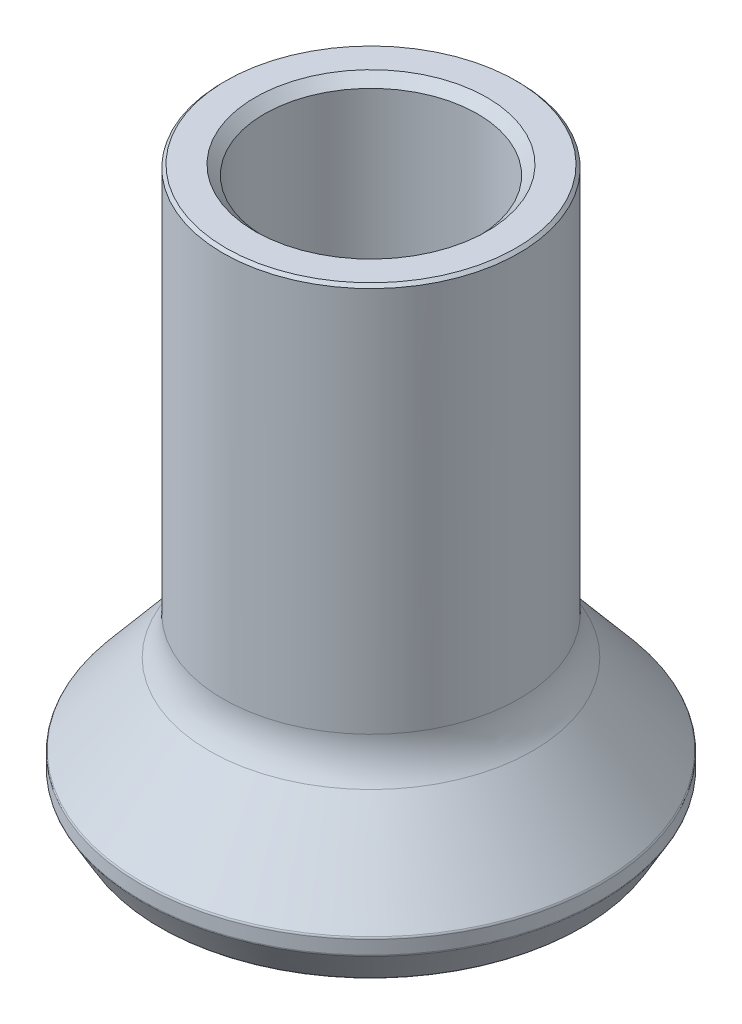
ISO-10303-21;
HEADER;
FILE_DESCRIPTION(('STEP AP214'),'2;1');
FILE_NAME('part.step','',(''),(''),'','','');
FILE_SCHEMA(('AUTOMOTIVE_DESIGN { 1 0 10303 214 1 1 1 1 }'));
ENDSEC;
DATA;
#1=APPLICATION_CONTEXT('core data for automotive mechanical design processes');
#2=APPLICATION_PROTOCOL_DEFINITION('international standard','automotive_design',2000,#1);
#3=PRODUCT_CONTEXT('',#1,'mechanical');
#4=PRODUCT('Part','Part','',(#3));
#5=PRODUCT_RELATED_PRODUCT_CATEGORY('part','',(#4));
#6=PRODUCT_DEFINITION_FORMATION('','',#4);
#7=PRODUCT_DEFINITION_CONTEXT('part definition',#1,'design');
#8=PRODUCT_DEFINITION('design','',#6,#7);
#9=PRODUCT_DEFINITION_SHAPE('','',#8);
#10=(LENGTH_UNIT() NAMED_UNIT(*) SI_UNIT(.MILLI.,.METRE.));
#11=(NAMED_UNIT(*) PLANE_ANGLE_UNIT() SI_UNIT($,.RADIAN.));
#12=(NAMED_UNIT(*) SI_UNIT($,.STERADIAN.) SOLID_ANGLE_UNIT());
#13=UNCERTAINTY_MEASURE_WITH_UNIT(LENGTH_MEASURE(1.E-05),#10,'distance_accuracy_value','');
#14=(GEOMETRIC_REPRESENTATION_CONTEXT(3) GLOBAL_UNCERTAINTY_ASSIGNED_CONTEXT((#13)) GLOBAL_UNIT_ASSIGNED_CONTEXT((#10,
#11,#12)) REPRESENTATION_CONTEXT('',''));
#15=CARTESIAN_POINT('',(0.,0.,0.));
#16=DIRECTION('',(0.,0.,1.));
#17=DIRECTION('',(1.,0.,0.));
#18=AXIS2_PLACEMENT_3D('',#15,#16,#17);
#19=CARTESIAN_POINT('',(17.205661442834,0.,0.));
#20=DIRECTION('',(0.,-1.,0.));
#21=DIRECTION('',(0.,0.,-1.));
#22=AXIS2_PLACEMENT_3D('',#19,#20,#21);
#23=PLANE('',#22);
#24=CARTESIAN_POINT('',(0.,0.,0.));
#25=DIRECTION('',(0.,-1.,0.));
#26=DIRECTION('',(0.,0.,-1.));
#27=AXIS2_PLACEMENT_3D('',#24,#25,#26);
#28=CIRCLE('',#27,17.3649290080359);
#29=CARTESIAN_POINT('',(0.,0.,-17.3649290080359));
#30=VERTEX_POINT('',#29);
#31=EDGE_CURVE('E54',#30,#30,#28,.F.);
#32=ORIENTED_EDGE('',*,*,#31,.T.);
#33=EDGE_LOOP('',(#32));
#34=FACE_BOUND('',#33,.T.);
#35=CARTESIAN_POINT('',(0.,0.,0.));
#36=DIRECTION('',(0.,-1.,0.));
#37=DIRECTION('',(0.,0.,-1.));
#38=AXIS2_PLACEMENT_3D('',#35,#36,#37);
#39=CIRCLE('',#38,17.6390816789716);
#40=CARTESIAN_POINT('',(0.,0.,-17.6390816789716));
#41=VERTEX_POINT('',#40);
#42=EDGE_CURVE('E59',#41,#41,#39,.T.);
#43=ORIENTED_EDGE('',*,*,#42,.T.);
#44=EDGE_LOOP('',(#43));
#45=FACE_BOUND('',#44,.T.);
#46=ADVANCED_FACE('F38',(#34,#45),#23,.T.);
#47=CARTESIAN_POINT('',(0.,2.8,0.));
#48=DIRECTION('',(0.,-1.,0.));
#49=DIRECTION('',(0.,0.,-1.));
#50=AXIS2_PLACEMENT_3D('',#47,#48,#49);
#51=CONICAL_SURFACE('',#50,15.9,0.43633231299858);
#52=CARTESIAN_POINT('',(0.,0.144345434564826,0.));
#53=DIRECTION('',(0.,1.,0.));
#54=DIRECTION('',(0.,0.,1.));
#55=AXIS2_PLACEMENT_3D('',#52,#53,#54);
#56=CIRCLE('',#55,17.1383520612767);
#57=CARTESIAN_POINT('',(0.,0.144345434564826,17.1383520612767));
#58=VERTEX_POINT('',#57);
#59=EDGE_CURVE('E62',#58,#58,#56,.F.);
#60=ORIENTED_EDGE('',*,*,#59,.T.);
#61=EDGE_LOOP('',(#60));
#62=FACE_BOUND('',#61,.T.);
#63=CARTESIAN_POINT('',(0.,2.65565456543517,0.));
#64=DIRECTION('',(0.,-1.,0.));
#65=DIRECTION('',(0.,0.,-1.));
#66=AXIS2_PLACEMENT_3D('',#63,#64,#65);
#67=CIRCLE('',#66,15.9673093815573);
#68=CARTESIAN_POINT('',(0.,2.65565456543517,-15.9673093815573));
#69=VERTEX_POINT('',#68);
#70=EDGE_CURVE('E65',#69,#69,#67,.F.);
#71=ORIENTED_EDGE('',*,*,#70,.T.);
#72=EDGE_LOOP('',(#71));
#73=FACE_BOUND('',#72,.T.);
#74=ADVANCED_FACE('F134',(#62,#73),#51,.F.);
#75=CARTESIAN_POINT('',(7.05,2.8,0.));
#76=DIRECTION('',(0.,-1.,0.));
#77=DIRECTION('',(0.,0.,-1.));
#78=AXIS2_PLACEMENT_3D('',#75,#76,#77);
#79=PLANE('',#78);
#80=CARTESIAN_POINT('',(0.,2.8,0.));
#81=DIRECTION('',(0.,-1.,0.));
#82=DIRECTION('',(0.,0.,-1.));
#83=AXIS2_PLACEMENT_3D('',#80,#81,#82);
#84=CIRCLE('',#83,15.7407324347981);
#85=CARTESIAN_POINT('',(0.,2.8,-15.7407324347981));
#86=VERTEX_POINT('',#85);
#87=EDGE_CURVE('E50',#86,#86,#84,.T.);
#88=ORIENTED_EDGE('',*,*,#87,.T.);
#89=EDGE_LOOP('',(#88));
#90=FACE_BOUND('',#89,.T.);
#91=CARTESIAN_POINT('',(0.,2.8,0.));
#92=DIRECTION('',(0.,-1.,0.));
#93=DIRECTION('',(0.,0.,-1.));
#94=AXIS2_PLACEMENT_3D('',#91,#92,#93);
#95=CIRCLE('',#94,7.55);
#96=CARTESIAN_POINT('',(0.,2.8,-7.55));
#97=VERTEX_POINT('',#96);
#98=EDGE_CURVE('E89',#97,#97,#95,.F.);
#99=ORIENTED_EDGE('',*,*,#98,.T.);
#100=EDGE_LOOP('',(#99));
#101=FACE_BOUND('',#100,.T.);
#102=ADVANCED_FACE('F140',(#90,#101),#79,.T.);
#103=CARTESIAN_POINT('',(0.,0.,0.));
#104=DIRECTION('',(0.,-1.,0.));
#105=DIRECTION('',(0.,0.,-1.));
#106=AXIS2_PLACEMENT_3D('',#103,#104,#105);
#107=CYLINDRICAL_SURFACE('',#106,7.05);
#108=CARTESIAN_POINT('',(0.,3.3,0.));
#109=DIRECTION('',(0.,-1.,0.));
#110=DIRECTION('',(0.,0.,-1.));
#111=AXIS2_PLACEMENT_3D('',#108,#109,#110);
#112=CIRCLE('',#111,7.05);
#113=CARTESIAN_POINT('',(0.,3.3,-7.05));
#114=VERTEX_POINT('',#113);
#115=EDGE_CURVE('E92',#114,#114,#112,.T.);
#116=ORIENTED_EDGE('',*,*,#115,.T.);
#117=EDGE_LOOP('',(#116));
#118=FACE_BOUND('',#117,.T.);
#119=CARTESIAN_POINT('',(0.,10.8,0.));
#120=DIRECTION('',(0.,-1.,0.));
#121=DIRECTION('',(0.,0.,-1.));
#122=AXIS2_PLACEMENT_3D('',#119,#120,#121);
#123=CIRCLE('',#122,7.05);
#124=CARTESIAN_POINT('',(0.,10.8,-7.05));
#125=VERTEX_POINT('',#124);
#126=EDGE_CURVE('E101',#125,#125,#123,.T.);
#127=ORIENTED_EDGE('',*,*,#126,.F.);
#128=EDGE_LOOP('',(#127));
#129=FACE_BOUND('',#128,.T.);
#130=ADVANCED_FACE('F196',(#118,#129),#107,.F.);
#131=CARTESIAN_POINT('',(4.4,10.8,0.));
#132=DIRECTION('',(0.,-1.,0.));
#133=DIRECTION('',(0.,0.,-1.));
#134=AXIS2_PLACEMENT_3D('',#131,#132,#133);
#135=PLANE('',#134);
#136=CARTESIAN_POINT('',(0.,10.8,0.));
#137=DIRECTION('',(0.,-1.,0.));
#138=DIRECTION('',(0.,0.,-1.));
#139=AXIS2_PLACEMENT_3D('',#136,#137,#138);
#140=CIRCLE('',#139,4.9);
#141=CARTESIAN_POINT('',(0.,10.8,-4.9));
#142=VERTEX_POINT('',#141);
#143=EDGE_CURVE('E83',#142,#142,#140,.F.);
#144=ORIENTED_EDGE('',*,*,#143,.T.);
#145=EDGE_LOOP('',(#144));
#146=FACE_BOUND('',#145,.T.);
#147=ORIENTED_EDGE('',*,*,#126,.T.);
#148=EDGE_LOOP('',(#147));
#149=FACE_BOUND('',#148,.T.);
#150=ADVANCED_FACE('F203',(#146,#149),#135,.T.);
#151=CARTESIAN_POINT('',(0.,0.,0.));
#152=DIRECTION('',(0.,-1.,0.));
#153=DIRECTION('',(0.,0.,-1.));
#154=AXIS2_PLACEMENT_3D('',#151,#152,#153);
#155=CYLINDRICAL_SURFACE('',#154,4.4);
#156=CARTESIAN_POINT('',(0.,11.3,0.));
#157=DIRECTION('',(0.,-1.,0.));
#158=DIRECTION('',(0.,0.,-1.));
#159=AXIS2_PLACEMENT_3D('',#156,#157,#158);
#160=CIRCLE('',#159,4.4);
#161=CARTESIAN_POINT('',(0.,11.3,-4.4));
#162=VERTEX_POINT('',#161);
#163=EDGE_CURVE('E86',#162,#162,#160,.T.);
#164=ORIENTED_EDGE('',*,*,#163,.T.);
#165=EDGE_LOOP('',(#164));
#166=FACE_BOUND('',#165,.T.);
#167=CARTESIAN_POINT('',(0.,19.9,0.));
#168=DIRECTION('',(0.,-1.,0.));
#169=DIRECTION('',(0.,0.,-1.));
#170=AXIS2_PLACEMENT_3D('',#167,#168,#169);
#171=CIRCLE('',#170,4.4);
#172=CARTESIAN_POINT('',(0.,19.9,-4.4));
#173=VERTEX_POINT('',#172);
#174=EDGE_CURVE('E104',#173,#173,#171,.T.);
#175=ORIENTED_EDGE('',*,*,#174,.F.);
#176=EDGE_LOOP('',(#175));
#177=FACE_BOUND('',#176,.T.);
#178=ADVANCED_FACE('F208',(#166,#177),#155,.F.);
#179=CARTESIAN_POINT('',(9.,19.9,0.));
#180=DIRECTION('',(0.,1.,0.));
#181=DIRECTION('',(0.,0.,1.));
#182=AXIS2_PLACEMENT_3D('',#179,#180,#181);
#183=PLANE('',#182);
#184=ORIENTED_EDGE('',*,*,#174,.T.);
#185=EDGE_LOOP('',(#184));
#186=FACE_BOUND('',#185,.T.);
#187=CARTESIAN_POINT('',(0.,19.9,0.));
#188=DIRECTION('',(0.,-1.,0.));
#189=DIRECTION('',(0.,0.,-1.));
#190=AXIS2_PLACEMENT_3D('',#187,#188,#189);
#191=CIRCLE('',#190,9.);
#192=CARTESIAN_POINT('',(0.,19.9,-9.));
#193=VERTEX_POINT('',#192);
#194=EDGE_CURVE('E107',#193,#193,#191,.T.);
#195=ORIENTED_EDGE('',*,*,#194,.F.);
#196=EDGE_LOOP('',(#195));
#197=FACE_BOUND('',#196,.T.);
#198=ADVANCED_FACE('F214',(#186,#197),#183,.T.);
#199=CARTESIAN_POINT('',(0.,0.,0.));
#200=DIRECTION('',(0.,-1.,0.));
#201=DIRECTION('',(0.,0.,-1.));
#202=AXIS2_PLACEMENT_3D('',#199,#200,#201);
#203=CYLINDRICAL_SURFACE('',#202,9.);
#204=CARTESIAN_POINT('',(0.,46.2,0.));
#205=DIRECTION('',(0.,1.,0.));
#206=DIRECTION('',(0.,0.,1.));
#207=AXIS2_PLACEMENT_3D('',#204,#205,#206);
#208=CIRCLE('',#207,9.);
#209=CARTESIAN_POINT('',(0.,46.2,9.));
#210=VERTEX_POINT('',#209);
#211=EDGE_CURVE('E95',#210,#210,#208,.T.);
#212=ORIENTED_EDGE('',*,*,#211,.T.);
#213=EDGE_LOOP('',(#212));
#214=FACE_BOUND('',#213,.T.);
#215=ORIENTED_EDGE('',*,*,#194,.T.);
#216=EDGE_LOOP('',(#215));
#217=FACE_BOUND('',#216,.T.);
#218=ADVANCED_FACE('F220',(#214,#217),#203,.F.);
#219=CARTESIAN_POINT('',(12.5,47.,0.));
#220=DIRECTION('',(0.,1.,0.));
#221=DIRECTION('',(0.,0.,1.));
#222=AXIS2_PLACEMENT_3D('',#219,#220,#221);
#223=PLANE('',#222);
#224=CARTESIAN_POINT('',(0.,47.,0.));
#225=DIRECTION('',(0.,1.,0.));
#226=DIRECTION('',(0.,0.,1.));
#227=AXIS2_PLACEMENT_3D('',#224,#225,#226);
#228=CIRCLE('',#227,12.25);
#229=CARTESIAN_POINT('',(0.,47.,12.25));
#230=VERTEX_POINT('',#229);
#231=EDGE_CURVE('E10',#230,#230,#228,.T.);
#232=ORIENTED_EDGE('',*,*,#231,.T.);
#233=EDGE_LOOP('',(#232));
#234=FACE_BOUND('',#233,.T.);
#235=CARTESIAN_POINT('',(0.,47.,0.));
#236=DIRECTION('',(0.,1.,0.));
#237=DIRECTION('',(0.,0.,1.));
#238=AXIS2_PLACEMENT_3D('',#235,#236,#237);
#239=CIRCLE('',#238,9.8);
#240=CARTESIAN_POINT('',(0.,47.,9.8));
#241=VERTEX_POINT('',#240);
#242=EDGE_CURVE('E98',#241,#241,#239,.F.);
#243=ORIENTED_EDGE('',*,*,#242,.T.);
#244=EDGE_LOOP('',(#243));
#245=FACE_BOUND('',#244,.T.);
#246=ADVANCED_FACE('F131',(#234,#245),#223,.T.);
#247=CARTESIAN_POINT('',(0.,0.,0.));
#248=DIRECTION('',(0.,-1.,0.));
#249=DIRECTION('',(0.,0.,-1.));
#250=AXIS2_PLACEMENT_3D('',#247,#248,#249);
#251=CYLINDRICAL_SURFACE('',#250,12.5);
#252=CARTESIAN_POINT('',(0.,46.75,0.));
#253=DIRECTION('',(0.,1.,0.));
#254=DIRECTION('',(0.,0.,1.));
#255=AXIS2_PLACEMENT_3D('',#252,#253,#254);
#256=CIRCLE('',#255,12.5);
#257=CARTESIAN_POINT('',(0.,46.75,12.5));
#258=VERTEX_POINT('',#257);
#259=EDGE_CURVE('E46',#258,#258,#256,.F.);
#260=ORIENTED_EDGE('',*,*,#259,.T.);
#261=EDGE_LOOP('',(#260));
#262=FACE_BOUND('',#261,.T.);
#263=CARTESIAN_POINT('',(0.,14.142950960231,0.));
#264=DIRECTION('',(0.,-1.,0.));
#265=DIRECTION('',(0.,0.,-1.));
#266=AXIS2_PLACEMENT_3D('',#263,#264,#265);
#267=CIRCLE('',#266,12.5);
#268=CARTESIAN_POINT('',(0.,14.142950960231,-12.5));
#269=VERTEX_POINT('',#268);
#270=EDGE_CURVE('E110',#269,#269,#267,.T.);
#271=ORIENTED_EDGE('',*,*,#270,.F.);
#272=EDGE_LOOP('',(#271));
#273=FACE_BOUND('',#272,.T.);
#274=ADVANCED_FACE('F121',(#262,#273),#251,.T.);
#275=CARTESIAN_POINT('',(0.,14.142950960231,0.));
#276=DIRECTION('',(0.,-1.,0.));
#277=DIRECTION('',(0.,0.,-1.));
#278=AXIS2_PLACEMENT_3D('',#275,#276,#277);
#279=TOROIDAL_SURFACE('',#278,17.5,5.);
#280=ORIENTED_EDGE('',*,*,#270,.T.);
#281=EDGE_LOOP('',(#280));
#282=FACE_BOUND('',#281,.T.);
#283=CARTESIAN_POINT('',(0.,10.9290129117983,0.));
#284=DIRECTION('',(0.,-1.,0.));
#285=DIRECTION('',(0.,0.,-1.));
#286=AXIS2_PLACEMENT_3D('',#283,#284,#285);
#287=CIRCLE('',#286,13.6697777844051);
#288=CARTESIAN_POINT('',(0.,10.9290129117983,-13.6697777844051));
#289=VERTEX_POINT('',#288);
#290=EDGE_CURVE('E113',#289,#289,#287,.T.);
#291=ORIENTED_EDGE('',*,*,#290,.F.);
#292=EDGE_LOOP('',(#291));
#293=FACE_BOUND('',#292,.T.);
#294=ADVANCED_FACE('F119',(#282,#293),#279,.F.);
#295=CARTESIAN_POINT('',(0.,4.1,0.));
#296=DIRECTION('',(0.,-1.,0.));
#297=DIRECTION('',(0.,0.,-1.));
#298=AXIS2_PLACEMENT_3D('',#295,#296,#297);
#299=CONICAL_SURFACE('',#298,19.4,0.698131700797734);
#300=CARTESIAN_POINT('',(0.,4.16970434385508,0.));
#301=DIRECTION('',(0.,1.,0.));
#302=DIRECTION('',(0.,0.,1.));
#303=AXIS2_PLACEMENT_3D('',#300,#301,#302);
#304=CIRCLE('',#303,19.3415111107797);
#305=CARTESIAN_POINT('',(0.,4.16970434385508,19.3415111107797));
#306=VERTEX_POINT('',#305);
#307=EDGE_CURVE('E68',#306,#306,#304,.T.);
#308=ORIENTED_EDGE('',*,*,#307,.T.);
#309=EDGE_LOOP('',(#308));
#310=FACE_BOUND('',#309,.T.);
#311=ORIENTED_EDGE('',*,*,#290,.T.);
#312=EDGE_LOOP('',(#311));
#313=FACE_BOUND('',#312,.T.);
#314=ADVANCED_FACE('F117',(#310,#313),#299,.T.);
#315=CARTESIAN_POINT('',(0.,0.,0.));
#316=DIRECTION('',(0.,-1.,0.));
#317=DIRECTION('',(0.,0.,-1.));
#318=AXIS2_PLACEMENT_3D('',#315,#316,#317);
#319=CYLINDRICAL_SURFACE('',#318,19.4);
#320=CARTESIAN_POINT('',(0.,2.86698729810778,0.));
#321=DIRECTION('',(0.,1.,0.));
#322=DIRECTION('',(0.,0.,1.));
#323=AXIS2_PLACEMENT_3D('',#320,#321,#322);
#324=CIRCLE('',#323,19.4);
#325=CARTESIAN_POINT('',(0.,2.86698729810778,19.4));
#326=VERTEX_POINT('',#325);
#327=EDGE_CURVE('E71',#326,#326,#324,.T.);
#328=ORIENTED_EDGE('',*,*,#327,.T.);
#329=EDGE_LOOP('',(#328));
#330=FACE_BOUND('',#329,.T.);
#331=CARTESIAN_POINT('',(0.,4.00900744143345,0.));
#332=DIRECTION('',(0.,1.,0.));
#333=DIRECTION('',(0.,0.,1.));
#334=AXIS2_PLACEMENT_3D('',#331,#332,#333);
#335=CIRCLE('',#334,19.4);
#336=CARTESIAN_POINT('',(0.,4.00900744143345,19.4));
#337=VERTEX_POINT('',#336);
#338=EDGE_CURVE('E74',#337,#337,#335,.F.);
#339=ORIENTED_EDGE('',*,*,#338,.T.);
#340=EDGE_LOOP('',(#339));
#341=FACE_BOUND('',#340,.T.);
#342=ADVANCED_FACE('F128',(#330,#341),#319,.T.);
#343=CARTESIAN_POINT('',(0.,0.,0.));
#344=DIRECTION('',(0.,1.,0.));
#345=DIRECTION('',(0.,0.,1.));
#346=AXIS2_PLACEMENT_3D('',#343,#344,#345);
#347=CONICAL_SURFACE('',#346,17.783419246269,0.5235987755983);
#348=CARTESIAN_POINT('',(0.,2.74198729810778,0.));
#349=DIRECTION('',(0.,-1.,0.));
#350=DIRECTION('',(0.,0.,-1.));
#351=AXIS2_PLACEMENT_3D('',#348,#349,#350);
#352=CIRCLE('',#351,19.3665063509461);
#353=CARTESIAN_POINT('',(0.,2.74198729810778,-19.3665063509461));
#354=VERTEX_POINT('',#353);
#355=EDGE_CURVE('E77',#354,#354,#352,.T.);
#356=ORIENTED_EDGE('',*,*,#355,.T.);
#357=EDGE_LOOP('',(#356));
#358=FACE_BOUND('',#357,.T.);
#359=CARTESIAN_POINT('',(0.,0.125000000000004,0.));
#360=DIRECTION('',(0.,-1.,0.));
#361=DIRECTION('',(0.,0.,-1.));
#362=AXIS2_PLACEMENT_3D('',#359,#360,#361);
#363=CIRCLE('',#362,17.8555880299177);
#364=CARTESIAN_POINT('',(0.,0.125000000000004,-17.8555880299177));
#365=VERTEX_POINT('',#364);
#366=EDGE_CURVE('E80',#365,#365,#363,.F.);
#367=ORIENTED_EDGE('',*,*,#366,.T.);
#368=EDGE_LOOP('',(#367));
#369=FACE_BOUND('',#368,.T.);
#370=ADVANCED_FACE('F154',(#358,#369),#347,.T.);
#371=CARTESIAN_POINT('',(0.,47.,0.));
#372=DIRECTION('',(0.,1.,0.));
#373=DIRECTION('',(0.,0.,1.));
#374=AXIS2_PLACEMENT_3D('',#371,#372,#373);
#375=CONICAL_SURFACE('',#374,9.8,0.785398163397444);
#376=ORIENTED_EDGE('',*,*,#211,.F.);
#377=EDGE_LOOP('',(#376));
#378=FACE_BOUND('',#377,.T.);
#379=ORIENTED_EDGE('',*,*,#242,.F.);
#380=EDGE_LOOP('',(#379));
#381=FACE_BOUND('',#380,.T.);
#382=ADVANCED_FACE('F147',(#378,#381),#375,.F.);
#383=CARTESIAN_POINT('',(0.,3.3,0.));
#384=DIRECTION('',(0.,-1.,0.));
#385=DIRECTION('',(0.,0.,-1.));
#386=AXIS2_PLACEMENT_3D('',#383,#384,#385);
#387=CONICAL_SURFACE('',#386,7.05,0.785398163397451);
#388=ORIENTED_EDGE('',*,*,#98,.F.);
#389=EDGE_LOOP('',(#388));
#390=FACE_BOUND('',#389,.T.);
#391=ORIENTED_EDGE('',*,*,#115,.F.);
#392=EDGE_LOOP('',(#391));
#393=FACE_BOUND('',#392,.T.);
#394=ADVANCED_FACE('F153',(#390,#393),#387,.F.);
#395=CARTESIAN_POINT('',(0.,11.3,0.));
#396=DIRECTION('',(0.,-1.,0.));
#397=DIRECTION('',(0.,0.,-1.));
#398=AXIS2_PLACEMENT_3D('',#395,#396,#397);
#399=CONICAL_SURFACE('',#398,4.4,0.785398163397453);
#400=ORIENTED_EDGE('',*,*,#143,.F.);
#401=EDGE_LOOP('',(#400));
#402=FACE_BOUND('',#401,.T.);
#403=ORIENTED_EDGE('',*,*,#163,.F.);
#404=EDGE_LOOP('',(#403));
#405=FACE_BOUND('',#404,.T.);
#406=ADVANCED_FACE('F161',(#402,#405),#399,.F.);
#407=CARTESIAN_POINT('',(0.,2.86698729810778,0.));
#408=DIRECTION('',(0.,1.,0.));
#409=DIRECTION('',(0.,0.,1.));
#410=AXIS2_PLACEMENT_3D('',#407,#408,#409);
#411=TOROIDAL_SURFACE('',#410,19.15,0.25);
#412=ORIENTED_EDGE('',*,*,#327,.F.);
#413=EDGE_LOOP('',(#412));
#414=FACE_BOUND('',#413,.T.);
#415=ORIENTED_EDGE('',*,*,#355,.F.);
#416=EDGE_LOOP('',(#415));
#417=FACE_BOUND('',#416,.T.);
#418=ADVANCED_FACE('F167',(#414,#417),#411,.T.);
#419=CARTESIAN_POINT('',(0.,4.00900744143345,0.));
#420=DIRECTION('',(0.,1.,0.));
#421=DIRECTION('',(0.,0.,1.));
#422=AXIS2_PLACEMENT_3D('',#419,#420,#421);
#423=TOROIDAL_SURFACE('',#422,19.15,0.25);
#424=ORIENTED_EDGE('',*,*,#307,.F.);
#425=EDGE_LOOP('',(#424));
#426=FACE_BOUND('',#425,.T.);
#427=ORIENTED_EDGE('',*,*,#338,.F.);
#428=EDGE_LOOP('',(#427));
#429=FACE_BOUND('',#428,.T.);
#430=ADVANCED_FACE('F171',(#426,#429),#423,.T.);
#431=CARTESIAN_POINT('',(0.,0.25,0.));
#432=DIRECTION('',(0.,-1.,0.));
#433=DIRECTION('',(0.,0.,-1.));
#434=AXIS2_PLACEMENT_3D('',#431,#432,#433);
#435=TOROIDAL_SURFACE('',#434,17.3649290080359,0.25);
#436=ORIENTED_EDGE('',*,*,#31,.F.);
#437=EDGE_LOOP('',(#436));
#438=FACE_BOUND('',#437,.T.);
#439=ORIENTED_EDGE('',*,*,#59,.F.);
#440=EDGE_LOOP('',(#439));
#441=FACE_BOUND('',#440,.T.);
#442=ADVANCED_FACE('F175',(#438,#441),#435,.T.);
#443=CARTESIAN_POINT('',(0.,0.25,0.));
#444=DIRECTION('',(0.,-1.,0.));
#445=DIRECTION('',(0.,0.,-1.));
#446=AXIS2_PLACEMENT_3D('',#443,#444,#445);
#447=TOROIDAL_SURFACE('',#446,17.6390816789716,0.25);
#448=ORIENTED_EDGE('',*,*,#366,.F.);
#449=EDGE_LOOP('',(#448));
#450=FACE_BOUND('',#449,.T.);
#451=ORIENTED_EDGE('',*,*,#42,.F.);
#452=EDGE_LOOP('',(#451));
#453=FACE_BOUND('',#452,.T.);
#454=ADVANCED_FACE('F179',(#450,#453),#447,.T.);
#455=CARTESIAN_POINT('',(0.,2.55,0.));
#456=DIRECTION('',(0.,-1.,0.));
#457=DIRECTION('',(0.,0.,-1.));
#458=AXIS2_PLACEMENT_3D('',#455,#456,#457);
#459=TOROIDAL_SURFACE('',#458,15.7407324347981,0.25);
#460=ORIENTED_EDGE('',*,*,#70,.F.);
#461=EDGE_LOOP('',(#460));
#462=FACE_BOUND('',#461,.T.);
#463=ORIENTED_EDGE('',*,*,#87,.F.);
#464=EDGE_LOOP('',(#463));
#465=FACE_BOUND('',#464,.T.);
#466=ADVANCED_FACE('F182',(#462,#465),#459,.F.);
#467=CARTESIAN_POINT('',(0.,46.75,0.));
#468=DIRECTION('',(0.,-1.,0.));
#469=DIRECTION('',(0.,0.,-1.));
#470=AXIS2_PLACEMENT_3D('',#467,#468,#469);
#471=CONICAL_SURFACE('',#470,12.5,0.785398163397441);
#472=ORIENTED_EDGE('',*,*,#231,.F.);
#473=EDGE_LOOP('',(#472));
#474=FACE_BOUND('',#473,.T.);
#475=ORIENTED_EDGE('',*,*,#259,.F.);
#476=EDGE_LOOP('',(#475));
#477=FACE_BOUND('',#476,.T.);
#478=ADVANCED_FACE('F41',(#474,#477),#471,.T.);
#479=CLOSED_SHELL('',(#46,#74,#102,#130,#150,#178,#198,#218,#246,#274,#294,#314,#342,#370,#382,
#394,#406,#418,#430,#442,#454,#466,#478));
#480=MANIFOLD_SOLID_BREP('B2',#479);
#481=ADVANCED_BREP_SHAPE_REPRESENTATION('',(#18,#480),#14);
#482=SHAPE_DEFINITION_REPRESENTATION(#9,#481);
ENDSEC;
END-ISO-10303-21;
